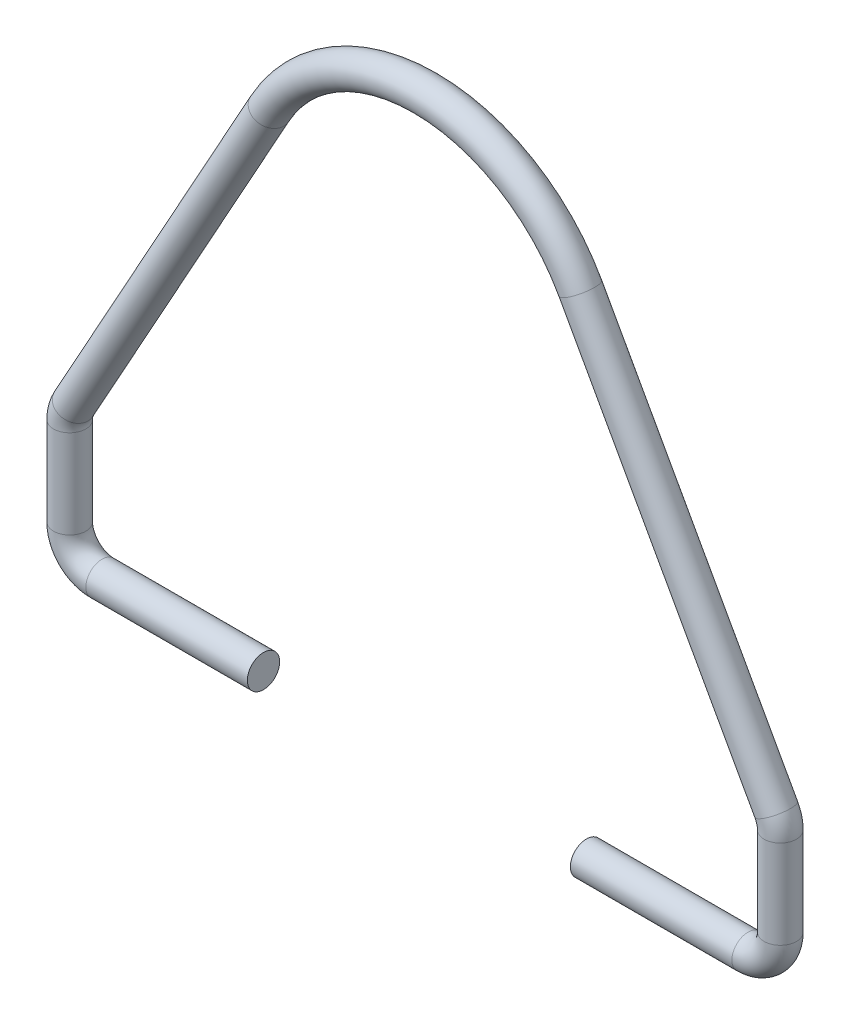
from build123d import *

# Parameters (mm, degrees)
SKETCH_2_R = 0.5


with BuildPart() as part:
    # Sweep 1: sweep along a path in Sketch 1
    with BuildLine(Plane.XY) as sweep_1_path:
        Line((-5, -12.5), (-10, -12.5))
        ThreePointArc((-10, -12.5), (-10.707106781, -12.207106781), (-11, -11.5))
        Line((-11, -11.5), (-11, -8.758614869))
        ThreePointArc((-11, -8.758614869), (-10.968148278, -8.508237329), (-10.874622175, -8.273809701))
        Line((-10.874622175, -8.273809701), (-4.810421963, 2.666428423))
        ThreePointArc((-4.810421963, 2.666428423), (0, 5.5), (4.810421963, 2.666428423))
        Line((4.810421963, 2.666428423), (10.874622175, -8.273809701))
        ThreePointArc((10.874622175, -8.273809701), (10.968148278, -8.508237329), (11, -8.758614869))
        Line((11, -8.758614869), (11, -11.5))
        ThreePointArc((11, -11.5), (10.707106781, -12.207106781), (10, -12.5))
        Line((10, -12.5), (5, -12.5))
    # Sketch 2 → Sweep 1 (sweep)
    with BuildSketch(Plane(origin=(-5, 0, 0), x_dir=(0, 0, -1), z_dir=(1, 0, 0))):
        with Locations((0, -12.5)):
            Circle(SKETCH_2_R)
    sweep(path=sweep_1_path.line)


solid = part.part
